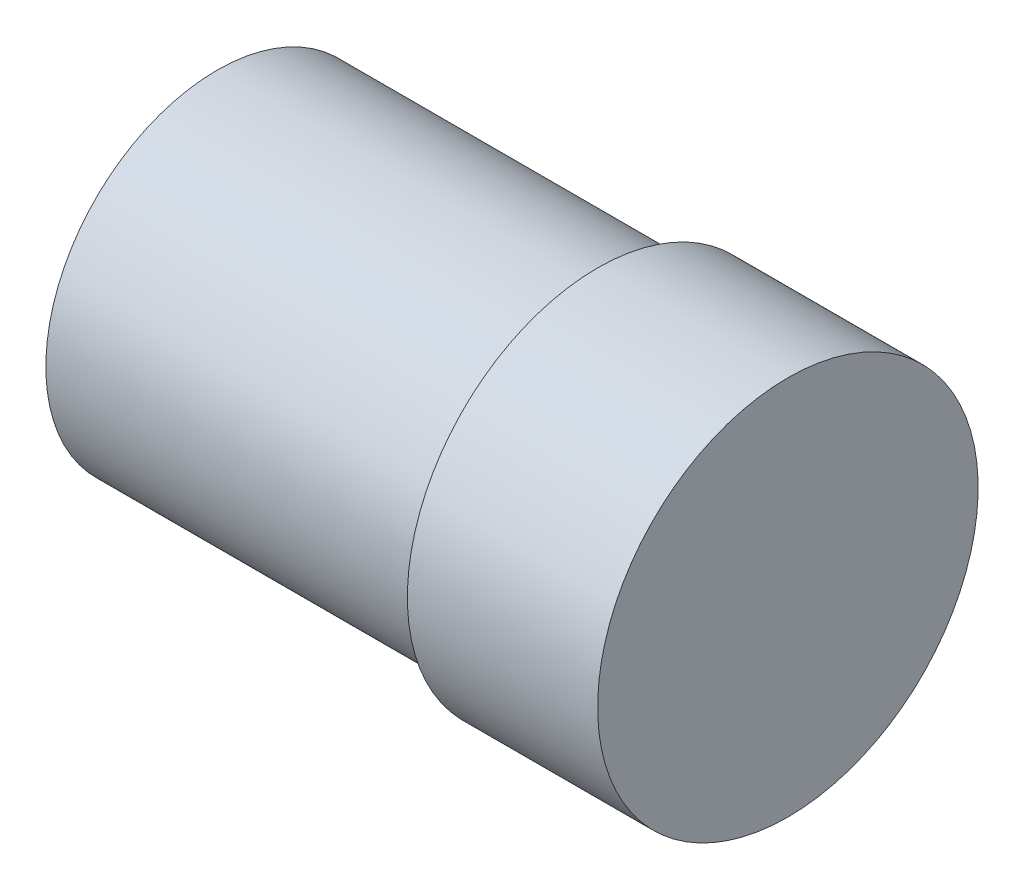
ISO-10303-21;
HEADER;
FILE_DESCRIPTION(('STEP AP214'),'2;1');
FILE_NAME('part.step','',(''),(''),'','','');
FILE_SCHEMA(('AUTOMOTIVE_DESIGN { 1 0 10303 214 1 1 1 1 }'));
ENDSEC;
DATA;
#1=APPLICATION_CONTEXT('core data for automotive mechanical design processes');
#2=APPLICATION_PROTOCOL_DEFINITION('international standard','automotive_design',2000,#1);
#3=PRODUCT_CONTEXT('',#1,'mechanical');
#4=PRODUCT('Part','Part','',(#3));
#5=PRODUCT_RELATED_PRODUCT_CATEGORY('part','',(#4));
#6=PRODUCT_DEFINITION_FORMATION('','',#4);
#7=PRODUCT_DEFINITION_CONTEXT('part definition',#1,'design');
#8=PRODUCT_DEFINITION('design','',#6,#7);
#9=PRODUCT_DEFINITION_SHAPE('','',#8);
#10=(LENGTH_UNIT() NAMED_UNIT(*) SI_UNIT(.MILLI.,.METRE.));
#11=(NAMED_UNIT(*) PLANE_ANGLE_UNIT() SI_UNIT($,.RADIAN.));
#12=(NAMED_UNIT(*) SI_UNIT($,.STERADIAN.) SOLID_ANGLE_UNIT());
#13=UNCERTAINTY_MEASURE_WITH_UNIT(LENGTH_MEASURE(1.E-05),#10,'distance_accuracy_value','');
#14=(GEOMETRIC_REPRESENTATION_CONTEXT(3) GLOBAL_UNCERTAINTY_ASSIGNED_CONTEXT((#13)) GLOBAL_UNIT_ASSIGNED_CONTEXT((#10,
#11,#12)) REPRESENTATION_CONTEXT('',''));
#15=CARTESIAN_POINT('',(0.,0.,0.));
#16=DIRECTION('',(0.,0.,1.));
#17=DIRECTION('',(1.,0.,0.));
#18=AXIS2_PLACEMENT_3D('',#15,#16,#17);
#19=CARTESIAN_POINT('',(0.,0.,0.));
#20=DIRECTION('',(-1.,0.,0.));
#21=DIRECTION('',(0.,-1.,0.));
#22=AXIS2_PLACEMENT_3D('',#19,#20,#21);
#23=PLANE('',#22);
#24=CARTESIAN_POINT('',(0.,0.,0.));
#25=DIRECTION('',(1.,0.,0.));
#26=DIRECTION('',(0.,1.,0.));
#27=AXIS2_PLACEMENT_3D('',#24,#25,#26);
#28=CIRCLE('',#27,4.5);
#29=CARTESIAN_POINT('',(0.,4.5,0.));
#30=VERTEX_POINT('',#29);
#31=EDGE_CURVE('E10',#30,#30,#28,.T.);
#32=ORIENTED_EDGE('',*,*,#31,.F.);
#33=EDGE_LOOP('',(#32));
#34=FACE_BOUND('',#33,.T.);
#35=ADVANCED_FACE('F24',(#34),#23,.T.);
#36=CARTESIAN_POINT('',(15.,0.,0.));
#37=DIRECTION('',(1.,0.,0.));
#38=DIRECTION('',(0.,1.,0.));
#39=AXIS2_PLACEMENT_3D('',#36,#37,#38);
#40=CYLINDRICAL_SURFACE('',#39,4.5);
#41=ORIENTED_EDGE('',*,*,#31,.T.);
#42=EDGE_LOOP('',(#41));
#43=FACE_BOUND('',#42,.T.);
#44=CARTESIAN_POINT('',(10.,0.,0.));
#45=DIRECTION('',(1.,0.,0.));
#46=DIRECTION('',(0.,1.,0.));
#47=AXIS2_PLACEMENT_3D('',#44,#45,#46);
#48=CIRCLE('',#47,4.5);
#49=CARTESIAN_POINT('',(10.,4.5,0.));
#50=VERTEX_POINT('',#49);
#51=EDGE_CURVE('E30',#50,#50,#48,.T.);
#52=ORIENTED_EDGE('',*,*,#51,.F.);
#53=EDGE_LOOP('',(#52));
#54=FACE_BOUND('',#53,.T.);
#55=ADVANCED_FACE('F56',(#43,#54),#40,.T.);
#56=CARTESIAN_POINT('',(10.,4.5,0.));
#57=DIRECTION('',(-1.,0.,0.));
#58=DIRECTION('',(0.,-1.,0.));
#59=AXIS2_PLACEMENT_3D('',#56,#57,#58);
#60=PLANE('',#59);
#61=ORIENTED_EDGE('',*,*,#51,.T.);
#62=EDGE_LOOP('',(#61));
#63=FACE_BOUND('',#62,.T.);
#64=CARTESIAN_POINT('',(10.,0.,0.));
#65=DIRECTION('',(1.,0.,0.));
#66=DIRECTION('',(0.,1.,0.));
#67=AXIS2_PLACEMENT_3D('',#64,#65,#66);
#68=CIRCLE('',#67,5.);
#69=CARTESIAN_POINT('',(10.,5.,0.));
#70=VERTEX_POINT('',#69);
#71=EDGE_CURVE('E34',#70,#70,#68,.T.);
#72=ORIENTED_EDGE('',*,*,#71,.F.);
#73=EDGE_LOOP('',(#72));
#74=FACE_BOUND('',#73,.T.);
#75=ADVANCED_FACE('F48',(#63,#74),#60,.T.);
#76=CARTESIAN_POINT('',(15.,0.,0.));
#77=DIRECTION('',(1.,0.,0.));
#78=DIRECTION('',(0.,1.,0.));
#79=AXIS2_PLACEMENT_3D('',#76,#77,#78);
#80=CYLINDRICAL_SURFACE('',#79,5.);
#81=ORIENTED_EDGE('',*,*,#71,.T.);
#82=EDGE_LOOP('',(#81));
#83=FACE_BOUND('',#82,.T.);
#84=CARTESIAN_POINT('',(15.,0.,0.));
#85=DIRECTION('',(1.,0.,0.));
#86=DIRECTION('',(0.,1.,0.));
#87=AXIS2_PLACEMENT_3D('',#84,#85,#86);
#88=CIRCLE('',#87,5.);
#89=CARTESIAN_POINT('',(15.,5.,0.));
#90=VERTEX_POINT('',#89);
#91=EDGE_CURVE('E38',#90,#90,#88,.T.);
#92=ORIENTED_EDGE('',*,*,#91,.F.);
#93=EDGE_LOOP('',(#92));
#94=FACE_BOUND('',#93,.T.);
#95=ADVANCED_FACE('F46',(#83,#94),#80,.T.);
#96=CARTESIAN_POINT('',(15.,5.,0.));
#97=DIRECTION('',(1.,0.,0.));
#98=DIRECTION('',(0.,1.,0.));
#99=AXIS2_PLACEMENT_3D('',#96,#97,#98);
#100=PLANE('',#99);
#101=ORIENTED_EDGE('',*,*,#91,.T.);
#102=EDGE_LOOP('',(#101));
#103=FACE_BOUND('',#102,.T.);
#104=ADVANCED_FACE('F44',(#103),#100,.T.);
#105=CLOSED_SHELL('',(#35,#55,#75,#95,#104));
#106=MANIFOLD_SOLID_BREP('B2',#105);
#107=ADVANCED_BREP_SHAPE_REPRESENTATION('',(#18,#106),#14);
#108=SHAPE_DEFINITION_REPRESENTATION(#9,#107);
ENDSEC;
END-ISO-10303-21;
